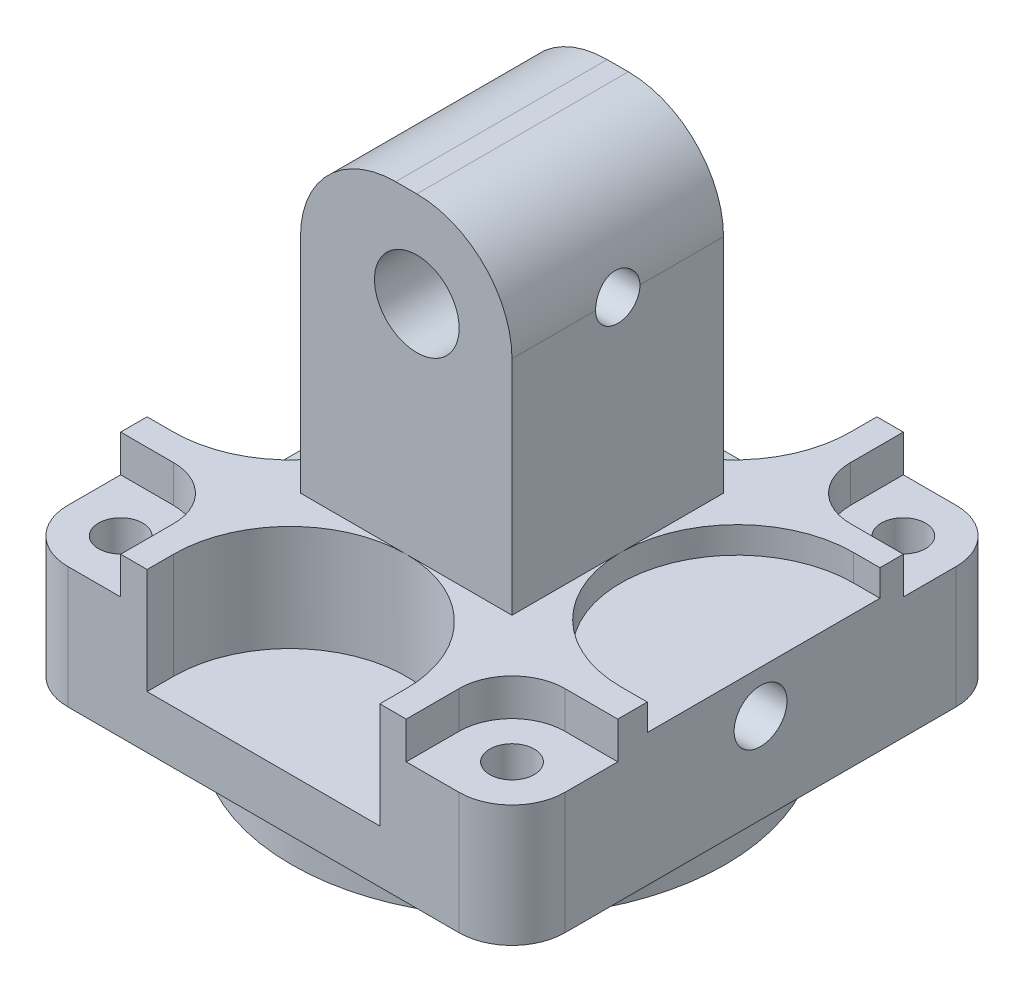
from build123d import *

# Parameters (mm, degrees)
ESQUISSE1_W                     = 47
ESQUISSE1_H                     = 15
EXTRUSION1_DEPTH                = 47
ESQUISSE2_R                     = 20.5
EXTRUSION2_DEPTH                = 5
ESQUISSE3_R                     = 9.75
EXTRUSION3_DEPTH                = 3.5
ENL_V_MAT_EXTRU_4_DEPTH         = 10
ENL_V_MAT_EXTRU_5_DEPTH         = 2.5
CONG_1_R                        = 5
ESQUISSE12_R                    = 2.1
ENL_V_MAT_EXTRU_6_DEPTH         = 58.563008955
ESQUISSE14_W                    = 5.25
ESQUISSE14_H                    = 20
TROU_TARAUD_M61_D               = 5
TROU_TARAUD_M61_DEPTH           = 19
TROU_TARAUD_M61_TIP             = 1.502151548
TROU_TARAUD_M61_ON_FACE_2_D     = 5
TROU_TARAUD_M61_ON_FACE_2_DEPTH = 19
TROU_TARAUD_M61_ON_FACE_2_TIP   = 1.502151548
EXTRUSION5_DEPTH                = 3.5
ESQUISSE17_W                    = 20
ESQUISSE17_H                    = 20
EXTRUSION6_DEPTH                = 30
CONG_2_R                        = 9
ESQUISSE18_R                    = 4
EXTRUSION7_DEPTH                = 61.823515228
ESQUISSE19_R                    = 2.1
EXTRUSION8_DEPTH                = 10


with BuildPart() as part:
    # Esquisse1 → Extrusion1 (new body)
    with BuildSketch(Plane.XY):
        with Locations((0, 7.5)):
            Rectangle(ESQUISSE1_W, ESQUISSE1_H)
    extrude(amount=EXTRUSION1_DEPTH)

    # Esquisse2 → Extrusion2 (add)
    with BuildSketch(Plane.XZ):
        with Locations(Location((0, 23.847288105, 0), (0, 0, 90))):
            Circle(ESQUISSE2_R)
    extrude(amount=EXTRUSION2_DEPTH)

    # Esquisse3 → Extrusion3 (add)
    with BuildSketch(Plane.XZ.offset(5)):
        with Locations((0, 23.847288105)):
            Circle(ESQUISSE3_R)
    extrude(amount=EXTRUSION3_DEPTH)

    # Esquisse9 → Enl_v. mat.-Extru.4 (cut)
    with BuildSketch(Plane(origin=(0, 15, 0), x_dir=(-1, 0, 0), z_dir=(0, 1, 0))):
        with BuildLine():
            Line((11, 2.5), (11, 0))
            Line((11, 0), (-11, 0))
            Line((-11, 0), (-11, 2.5))
            ThreePointArc((-11, 2.5), (0, 13.5), (11, 2.5))
        make_face()
        with BuildLine():
            Line((-11, 44.5), (-11, 47))
            Line((-11, 47), (11, 47))
            Line((11, 47), (11, 44.5))
            ThreePointArc((11, 44.5), (0, 33.5), (-11, 44.5))
        make_face()
        with BuildLine():
            Line((21, 34.5), (23.5, 34.5))
            Line((23.5, 34.5), (23.5, 12.5))
            Line((23.5, 12.5), (21, 12.5))
            ThreePointArc((21, 12.5), (10, 23.5), (21, 34.5))
        make_face()
    extrude(amount=-ENL_V_MAT_EXTRU_4_DEPTH, mode=Mode.SUBTRACT)

    # Esquisse10 → Enl_v. mat.-Extru.5 (cut)
    with BuildSketch(Plane(origin=(0, 15, 0), x_dir=(-1, 0, 0), z_dir=(0, 1, 0))):
        with BuildLine():
            Line((-20.998018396, 34.211515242), (-23.5, 34.211515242))
            Line((-23.5, 34.211515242), (-23.5, 12.211515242))
            Line((-23.5, 12.211515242), (-20.998018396, 12.211515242))
            ThreePointArc((-20.998018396, 12.211515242), (-9.998018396, 23.211515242), (-20.998018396, 34.211515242))
        make_face()
    extrude(amount=-ENL_V_MAT_EXTRU_5_DEPTH, mode=Mode.SUBTRACT)

    # Cong_1
    cong_1_edges = [part.edges().sort_by_distance(p)[0] for p in [
        (23.5, 7.5, 47),
        (-23.5, 7.5, 47),
        (23.5, 7.5, 0),
        (-23.5, 7.5, 0),
    ]]
    fillet(cong_1_edges, radius=CONG_1_R)

    # Esquisse12 → Enl_v. mat.-Extru.6 (cut, through all)
    with BuildSketch(Plane(origin=(0, 15, 0), x_dir=(-1, 0, 0), z_dir=(0, 1, 0))):
        with Locations(Location((-18.5, 5, 0), (0, 0, 90))):
            Circle(ESQUISSE12_R)
        with Locations(Location((-18.5, 42, 0), (0, 0, 90))):
            Circle(ESQUISSE12_R)
        with Locations(Location((18.5, 42, 0), (0, 0, 90))):
            Circle(ESQUISSE12_R)
        with Locations(Location((18.5, 5, 0), (0, 0, 90))):
            Circle(ESQUISSE12_R)
    extrude(amount=-ENL_V_MAT_EXTRU_6_DEPTH, mode=Mode.SUBTRACT)

    # Esquisse14 → Enl_vement de mati_re-R_volution1 (revolve, cut)
    with BuildSketch(Plane(origin=(0, 0, 0), x_dir=(0, 0, -1), z_dir=(1, 0, 0))):
        with Locations((-26.472288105, 1.5)):
            Rectangle(ESQUISSE14_W, ESQUISSE14_H)
    revolve(axis=Axis((0, 11.5, 23.847288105), (0, -1, 0)), mode=Mode.SUBTRACT)

    # Trou taraud_ M61
    with Locations(Plane(origin=(23.5, 8.5, 23.5), x_dir=(0, 1, 0), z_dir=(1, 0, 0))):
        with Locations((0, 0)):
            Hole(TROU_TARAUD_M61_D / 2, depth=TROU_TARAUD_M61_DEPTH)
            with Locations((0, 0, -(TROU_TARAUD_M61_DEPTH + TROU_TARAUD_M61_TIP / 2))):  # 118° drill point
                Cone(0, TROU_TARAUD_M61_D / 2, TROU_TARAUD_M61_TIP, mode=Mode.SUBTRACT)

    # Trou taraud_ M61 on face 2
    with Locations(Plane(origin=(0, 21.225265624, 55.047556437), x_dir=(0, 1, 0), z_dir=(1, 0, 0))):
        with Locations((0, 0), (1.389803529, 3.918681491), (-0.503698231, 3.637381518)):
            Hole(TROU_TARAUD_M61_ON_FACE_2_D / 2, depth=TROU_TARAUD_M61_ON_FACE_2_DEPTH)
            with Locations((0, 0, -(TROU_TARAUD_M61_ON_FACE_2_DEPTH + TROU_TARAUD_M61_ON_FACE_2_TIP / 2))):  # 118° drill point
                Cone(0, TROU_TARAUD_M61_ON_FACE_2_D / 2, TROU_TARAUD_M61_ON_FACE_2_TIP, mode=Mode.SUBTRACT)

    # Esquisse16 → Extrusion5 (cut)
    with BuildSketch(Plane(origin=(0, 15, 0), x_dir=(1, 0, 0), z_dir=(0, 1, 0))):
        with BuildLine():
            Line((18.5, -37), (23.5, -37))
            Line((23.5, -37), (23.5, -42))
            ThreePointArc((23.5, -42), (22.035533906, -45.535533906), (18.5, -47))
            Line((18.5, -47), (13.5, -47))
            Line((13.5, -47), (13.5, -42))
            ThreePointArc((13.5, -42), (14.964466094, -38.464466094), (18.5, -37))
        make_face()
        with BuildLine():
            Line((-13.5, -42), (-13.5, -47))
            Line((-13.5, -47), (-18.5, -47))
            ThreePointArc((-18.5, -47), (-22.035533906, -45.535533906), (-23.5, -42))
            Line((-23.5, -42), (-23.5, -37))
            Line((-23.5, -37), (-18.5, -37))
            ThreePointArc((-18.5, -37), (-14.964466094, -38.464466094), (-13.5, -42))
        make_face()
        with BuildLine():
            Line((18.5, -10), (23.5, -10))
            Line((23.5, -10), (23.5, -5))
            ThreePointArc((23.5, -5), (22.035533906, -1.464466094), (18.5, 0))
            Line((18.5, 0), (13.5, 0))
            Line((13.5, 0), (13.5, -5))
            ThreePointArc((13.5, -5), (14.964466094, -8.535533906), (18.5, -10))
        make_face()
        with BuildLine():
            Line((-13.5, -5), (-13.5, 0))
            Line((-13.5, 0), (-18.5, 0))
            ThreePointArc((-18.5, 0), (-22.035533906, -1.464466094), (-23.5, -5))
            Line((-23.5, -5), (-23.5, -10))
            Line((-23.5, -10), (-18.5, -10))
            ThreePointArc((-18.5, -10), (-14.964466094, -8.535533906), (-13.5, -5))
        make_face()
    extrude(amount=-EXTRUSION5_DEPTH, mode=Mode.SUBTRACT)

    # Esquisse17 → Extrusion6 (add)
    with BuildSketch(Plane(origin=(0, 15, 0), x_dir=(1, 0, 0), z_dir=(0, 1, 0))):
        with Locations((0, -23.5)):
            Rectangle(ESQUISSE17_W, ESQUISSE17_H)
    extrude(amount=EXTRUSION6_DEPTH)

    # Cong_2
    cong_2_edges = [part.edges().sort_by_distance(p)[0] for p in [
        (-10, 45, 23.5),
        (10, 45, 23.5),
    ]]
    fillet(cong_2_edges, radius=CONG_2_R)

    # Esquisse18 → Extrusion7 (cut, through all)
    with BuildSketch(Plane.XY.offset(33.5)):
        with Locations((1, 36)):
            Circle(ESQUISSE18_R)
    extrude(amount=-EXTRUSION7_DEPTH, mode=Mode.SUBTRACT)

    # Esquisse19 → Extrusion8 (cut)
    with BuildSketch(Plane(origin=(10, 0, 0), x_dir=(0, 0, -1), z_dir=(1, 0, 0))):
        with Locations((-23.5, 36)):
            Circle(ESQUISSE19_R)
    extrude(amount=-EXTRUSION8_DEPTH, mode=Mode.SUBTRACT)


solid = part.part
